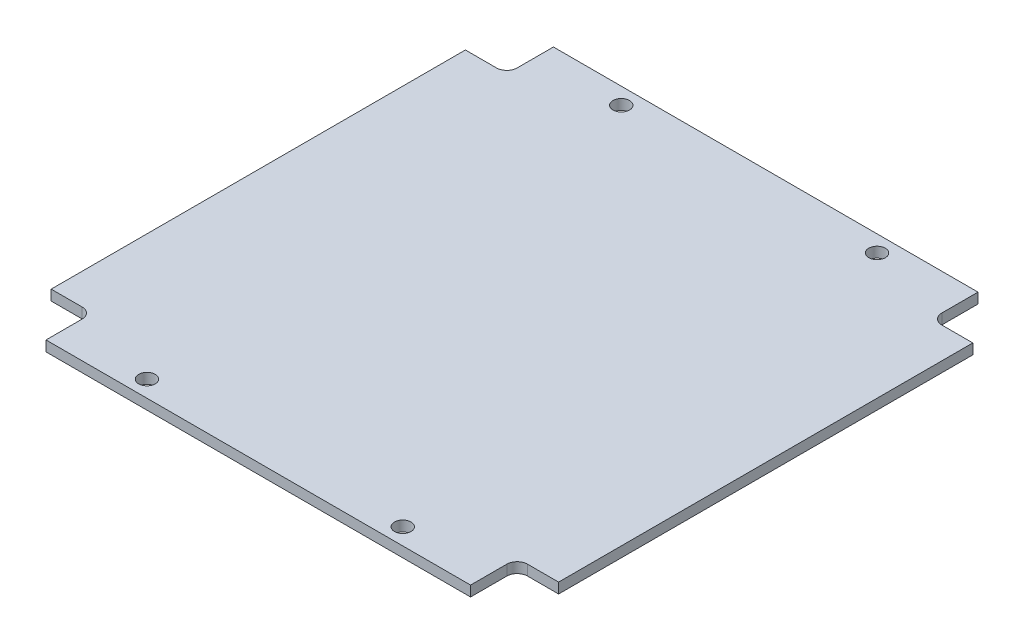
ISO-10303-21;
HEADER;
FILE_DESCRIPTION(('STEP AP214'),'2;1');
FILE_NAME('part.step','',(''),(''),'','','');
FILE_SCHEMA(('AUTOMOTIVE_DESIGN { 1 0 10303 214 1 1 1 1 }'));
ENDSEC;
DATA;
#1=APPLICATION_CONTEXT('core data for automotive mechanical design processes');
#2=APPLICATION_PROTOCOL_DEFINITION('international standard','automotive_design',2000,#1);
#3=PRODUCT_CONTEXT('',#1,'mechanical');
#4=PRODUCT('Part','Part','',(#3));
#5=PRODUCT_RELATED_PRODUCT_CATEGORY('part','',(#4));
#6=PRODUCT_DEFINITION_FORMATION('','',#4);
#7=PRODUCT_DEFINITION_CONTEXT('part definition',#1,'design');
#8=PRODUCT_DEFINITION('design','',#6,#7);
#9=PRODUCT_DEFINITION_SHAPE('','',#8);
#10=(LENGTH_UNIT() NAMED_UNIT(*) SI_UNIT(.MILLI.,.METRE.));
#11=(NAMED_UNIT(*) PLANE_ANGLE_UNIT() SI_UNIT($,.RADIAN.));
#12=(NAMED_UNIT(*) SI_UNIT($,.STERADIAN.) SOLID_ANGLE_UNIT());
#13=UNCERTAINTY_MEASURE_WITH_UNIT(LENGTH_MEASURE(1.E-05),#10,'distance_accuracy_value','');
#14=(GEOMETRIC_REPRESENTATION_CONTEXT(3) GLOBAL_UNCERTAINTY_ASSIGNED_CONTEXT((#13)) GLOBAL_UNIT_ASSIGNED_CONTEXT((#10,
#11,#12)) REPRESENTATION_CONTEXT('',''));
#15=CARTESIAN_POINT('',(0.,0.,0.));
#16=DIRECTION('',(0.,0.,1.));
#17=DIRECTION('',(1.,0.,0.));
#18=AXIS2_PLACEMENT_3D('',#15,#16,#17);
#19=CARTESIAN_POINT('',(-43.,2.,42.));
#20=DIRECTION('',(0.,-1.,0.));
#21=DIRECTION('',(0.,0.,-1.));
#22=AXIS2_PLACEMENT_3D('',#19,#20,#21);
#23=PLANE('',#22);
#24=DIRECTION('',(-1.,0.,0.));
#25=VECTOR('',#24,1.);
#26=CARTESIAN_POINT('',(-43.,2.,-40.));
#27=LINE('',#26,#25);
#28=CARTESIAN_POINT('',(-43.,2.,-40.));
#29=VERTEX_POINT('',#28);
#30=CARTESIAN_POINT('',(-49.,2.,-40.));
#31=VERTEX_POINT('',#30);
#32=EDGE_CURVE('E209',#29,#31,#27,.T.);
#33=ORIENTED_EDGE('',*,*,#32,.T.);
#34=DIRECTION('',(0.,0.,1.));
#35=VECTOR('',#34,1.);
#36=CARTESIAN_POINT('',(-49.,2.,-40.));
#37=LINE('',#36,#35);
#38=CARTESIAN_POINT('',(-49.,2.,40.));
#39=VERTEX_POINT('',#38);
#40=EDGE_CURVE('E117',#31,#39,#37,.T.);
#41=ORIENTED_EDGE('',*,*,#40,.T.);
#42=DIRECTION('',(1.,0.,0.));
#43=VECTOR('',#42,1.);
#44=CARTESIAN_POINT('',(-49.,2.,40.));
#45=LINE('',#44,#43);
#46=CARTESIAN_POINT('',(-43.,2.,40.));
#47=VERTEX_POINT('',#46);
#48=EDGE_CURVE('E248',#39,#47,#45,.T.);
#49=ORIENTED_EDGE('',*,*,#48,.T.);
#50=CARTESIAN_POINT('',(-43.,2.,42.));
#51=DIRECTION('',(0.,-1.,0.));
#52=DIRECTION('',(0.,0.,-1.));
#53=AXIS2_PLACEMENT_3D('',#50,#51,#52);
#54=CIRCLE('',#53,2.);
#55=CARTESIAN_POINT('',(-41.,2.,42.));
#56=VERTEX_POINT('',#55);
#57=EDGE_CURVE('E267',#47,#56,#54,.T.);
#58=ORIENTED_EDGE('',*,*,#57,.T.);
#59=DIRECTION('',(0.,0.,1.));
#60=VECTOR('',#59,1.);
#61=CARTESIAN_POINT('',(-41.,2.,42.));
#62=LINE('',#61,#60);
#63=CARTESIAN_POINT('',(-41.,2.,49.));
#64=VERTEX_POINT('',#63);
#65=EDGE_CURVE('E264',#56,#64,#62,.T.);
#66=ORIENTED_EDGE('',*,*,#65,.T.);
#67=DIRECTION('',(1.,0.,0.));
#68=VECTOR('',#67,1.);
#69=CARTESIAN_POINT('',(-41.,2.,49.));
#70=LINE('',#69,#68);
#71=CARTESIAN_POINT('',(41.,2.,49.));
#72=VERTEX_POINT('',#71);
#73=EDGE_CURVE('E266',#64,#72,#70,.T.);
#74=ORIENTED_EDGE('',*,*,#73,.T.);
#75=DIRECTION('',(0.,0.,-1.));
#76=VECTOR('',#75,1.);
#77=CARTESIAN_POINT('',(41.,2.,49.));
#78=LINE('',#77,#76);
#79=CARTESIAN_POINT('',(41.,2.,42.));
#80=VERTEX_POINT('',#79);
#81=EDGE_CURVE('E269',#72,#80,#78,.T.);
#82=ORIENTED_EDGE('',*,*,#81,.T.);
#83=CARTESIAN_POINT('',(43.,2.,42.));
#84=DIRECTION('',(0.,-1.,0.));
#85=DIRECTION('',(0.,0.,-1.));
#86=AXIS2_PLACEMENT_3D('',#83,#84,#85);
#87=CIRCLE('',#86,2.);
#88=CARTESIAN_POINT('',(43.,2.,40.));
#89=VERTEX_POINT('',#88);
#90=EDGE_CURVE('E275',#80,#89,#87,.T.);
#91=ORIENTED_EDGE('',*,*,#90,.T.);
#92=DIRECTION('',(1.,0.,0.));
#93=VECTOR('',#92,1.);
#94=CARTESIAN_POINT('',(43.,2.,40.));
#95=LINE('',#94,#93);
#96=CARTESIAN_POINT('',(49.,2.,40.));
#97=VERTEX_POINT('',#96);
#98=EDGE_CURVE('E277',#89,#97,#95,.T.);
#99=ORIENTED_EDGE('',*,*,#98,.T.);
#100=DIRECTION('',(0.,0.,-1.));
#101=VECTOR('',#100,1.);
#102=CARTESIAN_POINT('',(49.,2.,40.));
#103=LINE('',#102,#101);
#104=CARTESIAN_POINT('',(49.,2.,-40.));
#105=VERTEX_POINT('',#104);
#106=EDGE_CURVE('E279',#97,#105,#103,.T.);
#107=ORIENTED_EDGE('',*,*,#106,.T.);
#108=DIRECTION('',(-1.,0.,0.));
#109=VECTOR('',#108,1.);
#110=CARTESIAN_POINT('',(49.,2.,-40.));
#111=LINE('',#110,#109);
#112=CARTESIAN_POINT('',(43.,2.,-40.));
#113=VERTEX_POINT('',#112);
#114=EDGE_CURVE('E281',#105,#113,#111,.T.);
#115=ORIENTED_EDGE('',*,*,#114,.T.);
#116=CARTESIAN_POINT('',(43.,2.,-42.));
#117=DIRECTION('',(0.,-1.,0.));
#118=DIRECTION('',(0.,0.,-1.));
#119=AXIS2_PLACEMENT_3D('',#116,#117,#118);
#120=CIRCLE('',#119,2.);
#121=CARTESIAN_POINT('',(41.,2.,-42.));
#122=VERTEX_POINT('',#121);
#123=EDGE_CURVE('E283',#113,#122,#120,.T.);
#124=ORIENTED_EDGE('',*,*,#123,.T.);
#125=DIRECTION('',(0.,0.,-1.));
#126=VECTOR('',#125,1.);
#127=CARTESIAN_POINT('',(41.,2.,-42.));
#128=LINE('',#127,#126);
#129=CARTESIAN_POINT('',(41.,2.,-49.));
#130=VERTEX_POINT('',#129);
#131=EDGE_CURVE('E160',#122,#130,#128,.T.);
#132=ORIENTED_EDGE('',*,*,#131,.T.);
#133=DIRECTION('',(-1.,0.,0.));
#134=VECTOR('',#133,1.);
#135=CARTESIAN_POINT('',(41.,2.,-49.));
#136=LINE('',#135,#134);
#137=CARTESIAN_POINT('',(-41.,2.,-49.));
#138=VERTEX_POINT('',#137);
#139=EDGE_CURVE('E154',#130,#138,#136,.T.);
#140=ORIENTED_EDGE('',*,*,#139,.T.);
#141=DIRECTION('',(0.,0.,1.));
#142=VECTOR('',#141,1.);
#143=CARTESIAN_POINT('',(-41.,2.,-49.));
#144=LINE('',#143,#142);
#145=CARTESIAN_POINT('',(-41.,2.,-42.));
#146=VERTEX_POINT('',#145);
#147=EDGE_CURVE('E158',#138,#146,#144,.T.);
#148=ORIENTED_EDGE('',*,*,#147,.T.);
#149=CARTESIAN_POINT('',(-43.,2.,-42.));
#150=DIRECTION('',(0.,-1.,0.));
#151=DIRECTION('',(0.,0.,-1.));
#152=AXIS2_PLACEMENT_3D('',#149,#150,#151);
#153=CIRCLE('',#152,2.);
#154=EDGE_CURVE('E50',#146,#29,#153,.T.);
#155=ORIENTED_EDGE('',*,*,#154,.T.);
#156=EDGE_LOOP('',(#33,#41,#49,#58,#66,#74,#82,#91,#99,#107,#115,#124,#132,#140,#148,#155));
#157=FACE_BOUND('',#156,.T.);
#158=CARTESIAN_POINT('',(24.7,2.,45.8));
#159=DIRECTION('',(0.,1.,0.));
#160=DIRECTION('',(0.,0.,1.));
#161=AXIS2_PLACEMENT_3D('',#158,#159,#160);
#162=CIRCLE('',#161,1.59999999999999);
#163=CARTESIAN_POINT('',(24.7,2.,47.4));
#164=VERTEX_POINT('',#163);
#165=EDGE_CURVE('E352',#164,#164,#162,.T.);
#166=ORIENTED_EDGE('',*,*,#165,.F.);
#167=EDGE_LOOP('',(#166));
#168=FACE_BOUND('',#167,.T.);
#169=CARTESIAN_POINT('',(-24.7,2.,45.8));
#170=DIRECTION('',(0.,1.,0.));
#171=DIRECTION('',(0.,0.,1.));
#172=AXIS2_PLACEMENT_3D('',#169,#170,#171);
#173=CIRCLE('',#172,1.59999999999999);
#174=CARTESIAN_POINT('',(-24.7,2.,47.4));
#175=VERTEX_POINT('',#174);
#176=EDGE_CURVE('E346',#175,#175,#173,.T.);
#177=ORIENTED_EDGE('',*,*,#176,.F.);
#178=EDGE_LOOP('',(#177));
#179=FACE_BOUND('',#178,.T.);
#180=CARTESIAN_POINT('',(-24.7,2.,-45.8));
#181=DIRECTION('',(0.,1.,0.));
#182=DIRECTION('',(0.,0.,1.));
#183=AXIS2_PLACEMENT_3D('',#180,#181,#182);
#184=CIRCLE('',#183,1.59999999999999);
#185=CARTESIAN_POINT('',(-24.7,2.,-44.2));
#186=VERTEX_POINT('',#185);
#187=EDGE_CURVE('E338',#186,#186,#184,.T.);
#188=ORIENTED_EDGE('',*,*,#187,.F.);
#189=EDGE_LOOP('',(#188));
#190=FACE_BOUND('',#189,.T.);
#191=CARTESIAN_POINT('',(24.7,2.,-45.8));
#192=DIRECTION('',(0.,1.,0.));
#193=DIRECTION('',(0.,0.,1.));
#194=AXIS2_PLACEMENT_3D('',#191,#192,#193);
#195=CIRCLE('',#194,1.59999999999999);
#196=CARTESIAN_POINT('',(24.7,2.,-44.2));
#197=VERTEX_POINT('',#196);
#198=EDGE_CURVE('E335',#197,#197,#195,.T.);
#199=ORIENTED_EDGE('',*,*,#198,.F.);
#200=EDGE_LOOP('',(#199));
#201=FACE_BOUND('',#200,.T.);
#202=ADVANCED_FACE('F33',(#157,#168,#179,#190,#201),#23,.F.);
#203=CARTESIAN_POINT('',(-43.,0.,42.));
#204=DIRECTION('',(0.,-1.,0.));
#205=DIRECTION('',(0.,0.,-1.));
#206=AXIS2_PLACEMENT_3D('',#203,#204,#205);
#207=PLANE('',#206);
#208=CARTESIAN_POINT('',(24.7,0.,-45.8));
#209=DIRECTION('',(0.,1.,0.));
#210=DIRECTION('',(0.,0.,1.));
#211=AXIS2_PLACEMENT_3D('',#208,#209,#210);
#212=CIRCLE('',#211,1.59999999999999);
#213=CARTESIAN_POINT('',(24.7,0.,-44.2));
#214=VERTEX_POINT('',#213);
#215=EDGE_CURVE('E332',#214,#214,#212,.T.);
#216=ORIENTED_EDGE('',*,*,#215,.T.);
#217=EDGE_LOOP('',(#216));
#218=FACE_BOUND('',#217,.T.);
#219=CARTESIAN_POINT('',(-24.7,0.,-45.8));
#220=DIRECTION('',(0.,1.,0.));
#221=DIRECTION('',(0.,0.,1.));
#222=AXIS2_PLACEMENT_3D('',#219,#220,#221);
#223=CIRCLE('',#222,1.59999999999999);
#224=CARTESIAN_POINT('',(-24.7,0.,-44.2));
#225=VERTEX_POINT('',#224);
#226=EDGE_CURVE('E343',#225,#225,#223,.T.);
#227=ORIENTED_EDGE('',*,*,#226,.T.);
#228=EDGE_LOOP('',(#227));
#229=FACE_BOUND('',#228,.T.);
#230=CARTESIAN_POINT('',(-24.7,0.,45.8));
#231=DIRECTION('',(0.,1.,0.));
#232=DIRECTION('',(0.,0.,1.));
#233=AXIS2_PLACEMENT_3D('',#230,#231,#232);
#234=CIRCLE('',#233,1.59999999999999);
#235=CARTESIAN_POINT('',(-24.7,0.,47.4));
#236=VERTEX_POINT('',#235);
#237=EDGE_CURVE('E349',#236,#236,#234,.T.);
#238=ORIENTED_EDGE('',*,*,#237,.T.);
#239=EDGE_LOOP('',(#238));
#240=FACE_BOUND('',#239,.T.);
#241=DIRECTION('',(-1.,0.,0.));
#242=VECTOR('',#241,1.);
#243=CARTESIAN_POINT('',(-43.,0.,-40.));
#244=LINE('',#243,#242);
#245=CARTESIAN_POINT('',(-43.,0.,-40.));
#246=VERTEX_POINT('',#245);
#247=CARTESIAN_POINT('',(-49.,0.,-40.));
#248=VERTEX_POINT('',#247);
#249=EDGE_CURVE('E178',#246,#248,#244,.T.);
#250=ORIENTED_EDGE('',*,*,#249,.F.);
#251=CARTESIAN_POINT('',(-43.,0.,-42.));
#252=DIRECTION('',(0.,-1.,0.));
#253=DIRECTION('',(0.,0.,-1.));
#254=AXIS2_PLACEMENT_3D('',#251,#252,#253);
#255=CIRCLE('',#254,2.);
#256=CARTESIAN_POINT('',(-41.,0.,-42.));
#257=VERTEX_POINT('',#256);
#258=EDGE_CURVE('E109',#257,#246,#255,.T.);
#259=ORIENTED_EDGE('',*,*,#258,.F.);
#260=DIRECTION('',(0.,0.,1.));
#261=VECTOR('',#260,1.);
#262=CARTESIAN_POINT('',(-41.,0.,-49.));
#263=LINE('',#262,#261);
#264=CARTESIAN_POINT('',(-41.,0.,-49.));
#265=VERTEX_POINT('',#264);
#266=EDGE_CURVE('E103',#265,#257,#263,.T.);
#267=ORIENTED_EDGE('',*,*,#266,.F.);
#268=DIRECTION('',(-1.,0.,0.));
#269=VECTOR('',#268,1.);
#270=CARTESIAN_POINT('',(41.,0.,-49.));
#271=LINE('',#270,#269);
#272=CARTESIAN_POINT('',(41.,0.,-49.));
#273=VERTEX_POINT('',#272);
#274=EDGE_CURVE('E168',#273,#265,#271,.T.);
#275=ORIENTED_EDGE('',*,*,#274,.F.);
#276=DIRECTION('',(0.,0.,-1.));
#277=VECTOR('',#276,1.);
#278=CARTESIAN_POINT('',(41.,0.,-42.));
#279=LINE('',#278,#277);
#280=CARTESIAN_POINT('',(41.,0.,-42.));
#281=VERTEX_POINT('',#280);
#282=EDGE_CURVE('E204',#281,#273,#279,.T.);
#283=ORIENTED_EDGE('',*,*,#282,.F.);
#284=CARTESIAN_POINT('',(43.,0.,-42.));
#285=DIRECTION('',(0.,-1.,0.));
#286=DIRECTION('',(0.,0.,-1.));
#287=AXIS2_PLACEMENT_3D('',#284,#285,#286);
#288=CIRCLE('',#287,2.);
#289=CARTESIAN_POINT('',(43.,0.,-40.));
#290=VERTEX_POINT('',#289);
#291=EDGE_CURVE('E202',#290,#281,#288,.T.);
#292=ORIENTED_EDGE('',*,*,#291,.F.);
#293=DIRECTION('',(-1.,0.,0.));
#294=VECTOR('',#293,1.);
#295=CARTESIAN_POINT('',(49.,0.,-40.));
#296=LINE('',#295,#294);
#297=CARTESIAN_POINT('',(49.,0.,-40.));
#298=VERTEX_POINT('',#297);
#299=EDGE_CURVE('E200',#298,#290,#296,.T.);
#300=ORIENTED_EDGE('',*,*,#299,.F.);
#301=DIRECTION('',(0.,0.,-1.));
#302=VECTOR('',#301,1.);
#303=CARTESIAN_POINT('',(49.,0.,40.));
#304=LINE('',#303,#302);
#305=CARTESIAN_POINT('',(49.,0.,40.));
#306=VERTEX_POINT('',#305);
#307=EDGE_CURVE('E198',#306,#298,#304,.T.);
#308=ORIENTED_EDGE('',*,*,#307,.F.);
#309=DIRECTION('',(1.,0.,0.));
#310=VECTOR('',#309,1.);
#311=CARTESIAN_POINT('',(43.,0.,40.));
#312=LINE('',#311,#310);
#313=CARTESIAN_POINT('',(43.,0.,40.));
#314=VERTEX_POINT('',#313);
#315=EDGE_CURVE('E196',#314,#306,#312,.T.);
#316=ORIENTED_EDGE('',*,*,#315,.F.);
#317=CARTESIAN_POINT('',(43.,0.,42.));
#318=DIRECTION('',(0.,-1.,0.));
#319=DIRECTION('',(0.,0.,-1.));
#320=AXIS2_PLACEMENT_3D('',#317,#318,#319);
#321=CIRCLE('',#320,2.);
#322=CARTESIAN_POINT('',(41.,0.,42.));
#323=VERTEX_POINT('',#322);
#324=EDGE_CURVE('E194',#323,#314,#321,.T.);
#325=ORIENTED_EDGE('',*,*,#324,.F.);
#326=DIRECTION('',(0.,0.,-1.));
#327=VECTOR('',#326,1.);
#328=CARTESIAN_POINT('',(41.,0.,49.));
#329=LINE('',#328,#327);
#330=CARTESIAN_POINT('',(41.,0.,49.));
#331=VERTEX_POINT('',#330);
#332=EDGE_CURVE('E192',#331,#323,#329,.T.);
#333=ORIENTED_EDGE('',*,*,#332,.F.);
#334=DIRECTION('',(1.,0.,0.));
#335=VECTOR('',#334,1.);
#336=CARTESIAN_POINT('',(-41.,0.,49.));
#337=LINE('',#336,#335);
#338=CARTESIAN_POINT('',(-41.,0.,49.));
#339=VERTEX_POINT('',#338);
#340=EDGE_CURVE('E190',#339,#331,#337,.T.);
#341=ORIENTED_EDGE('',*,*,#340,.F.);
#342=DIRECTION('',(0.,0.,1.));
#343=VECTOR('',#342,1.);
#344=CARTESIAN_POINT('',(-41.,0.,42.));
#345=LINE('',#344,#343);
#346=CARTESIAN_POINT('',(-41.,0.,42.));
#347=VERTEX_POINT('',#346);
#348=EDGE_CURVE('E188',#347,#339,#345,.T.);
#349=ORIENTED_EDGE('',*,*,#348,.F.);
#350=CARTESIAN_POINT('',(-43.,0.,42.));
#351=DIRECTION('',(0.,-1.,0.));
#352=DIRECTION('',(0.,0.,-1.));
#353=AXIS2_PLACEMENT_3D('',#350,#351,#352);
#354=CIRCLE('',#353,2.);
#355=CARTESIAN_POINT('',(-43.,0.,40.));
#356=VERTEX_POINT('',#355);
#357=EDGE_CURVE('E186',#356,#347,#354,.T.);
#358=ORIENTED_EDGE('',*,*,#357,.F.);
#359=DIRECTION('',(1.,0.,0.));
#360=VECTOR('',#359,1.);
#361=CARTESIAN_POINT('',(-49.,0.,40.));
#362=LINE('',#361,#360);
#363=CARTESIAN_POINT('',(-49.,0.,40.));
#364=VERTEX_POINT('',#363);
#365=EDGE_CURVE('E184',#364,#356,#362,.T.);
#366=ORIENTED_EDGE('',*,*,#365,.F.);
#367=DIRECTION('',(0.,0.,1.));
#368=VECTOR('',#367,1.);
#369=CARTESIAN_POINT('',(-49.,0.,-40.));
#370=LINE('',#369,#368);
#371=EDGE_CURVE('E181',#248,#364,#370,.T.);
#372=ORIENTED_EDGE('',*,*,#371,.F.);
#373=EDGE_LOOP('',(#250,#259,#267,#275,#283,#292,#300,#308,#316,#325,#333,#341,#349,#358,#366,#372));
#374=FACE_BOUND('',#373,.T.);
#375=CARTESIAN_POINT('',(24.7,0.,45.8));
#376=DIRECTION('',(0.,1.,0.));
#377=DIRECTION('',(0.,0.,1.));
#378=AXIS2_PLACEMENT_3D('',#375,#376,#377);
#379=CIRCLE('',#378,1.59999999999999);
#380=CARTESIAN_POINT('',(24.7,0.,47.4));
#381=VERTEX_POINT('',#380);
#382=EDGE_CURVE('E182',#381,#381,#379,.T.);
#383=ORIENTED_EDGE('',*,*,#382,.T.);
#384=EDGE_LOOP('',(#383));
#385=FACE_BOUND('',#384,.T.);
#386=ADVANCED_FACE('F252',(#218,#229,#240,#374,#385),#207,.T.);
#387=CARTESIAN_POINT('',(-43.,2.,-40.));
#388=DIRECTION('',(0.,0.,1.));
#389=DIRECTION('',(1.,0.,0.));
#390=AXIS2_PLACEMENT_3D('',#387,#388,#389);
#391=PLANE('',#390);
#392=ORIENTED_EDGE('',*,*,#249,.T.);
#393=DIRECTION('',(0.,-1.,0.));
#394=VECTOR('',#393,1.);
#395=CARTESIAN_POINT('',(-49.,2.,-40.));
#396=LINE('',#395,#394);
#397=EDGE_CURVE('E11',#31,#248,#396,.T.);
#398=ORIENTED_EDGE('',*,*,#397,.F.);
#399=ORIENTED_EDGE('',*,*,#32,.F.);
#400=DIRECTION('',(0.,-1.,0.));
#401=VECTOR('',#400,1.);
#402=CARTESIAN_POINT('',(-43.,2.,-40.));
#403=LINE('',#402,#401);
#404=EDGE_CURVE('E174',#29,#246,#403,.T.);
#405=ORIENTED_EDGE('',*,*,#404,.T.);
#406=EDGE_LOOP('',(#392,#398,#399,#405));
#407=FACE_BOUND('',#406,.T.);
#408=ADVANCED_FACE('F35',(#407),#391,.F.);
#409=CARTESIAN_POINT('',(-49.,2.,-40.));
#410=DIRECTION('',(1.,0.,0.));
#411=DIRECTION('',(0.,0.,-1.));
#412=AXIS2_PLACEMENT_3D('',#409,#410,#411);
#413=PLANE('',#412);
#414=ORIENTED_EDGE('',*,*,#371,.T.);
#415=DIRECTION('',(0.,-1.,0.));
#416=VECTOR('',#415,1.);
#417=CARTESIAN_POINT('',(-49.,2.,40.));
#418=LINE('',#417,#416);
#419=EDGE_CURVE('E42',#39,#364,#418,.T.);
#420=ORIENTED_EDGE('',*,*,#419,.F.);
#421=ORIENTED_EDGE('',*,*,#40,.F.);
#422=ORIENTED_EDGE('',*,*,#397,.T.);
#423=EDGE_LOOP('',(#414,#420,#421,#422));
#424=FACE_BOUND('',#423,.T.);
#425=ADVANCED_FACE('F513',(#424),#413,.F.);
#426=CARTESIAN_POINT('',(-49.,2.,40.));
#427=DIRECTION('',(0.,0.,-1.));
#428=DIRECTION('',(-1.,0.,0.));
#429=AXIS2_PLACEMENT_3D('',#426,#427,#428);
#430=PLANE('',#429);
#431=ORIENTED_EDGE('',*,*,#365,.T.);
#432=DIRECTION('',(0.,-1.,0.));
#433=VECTOR('',#432,1.);
#434=CARTESIAN_POINT('',(-43.,2.,40.));
#435=LINE('',#434,#433);
#436=EDGE_CURVE('E240',#47,#356,#435,.T.);
#437=ORIENTED_EDGE('',*,*,#436,.F.);
#438=ORIENTED_EDGE('',*,*,#48,.F.);
#439=ORIENTED_EDGE('',*,*,#419,.T.);
#440=EDGE_LOOP('',(#431,#437,#438,#439));
#441=FACE_BOUND('',#440,.T.);
#442=ADVANCED_FACE('F246',(#441),#430,.F.);
#443=CARTESIAN_POINT('',(-43.,2.,42.));
#444=DIRECTION('',(0.,-1.,0.));
#445=DIRECTION('',(0.,0.,-1.));
#446=AXIS2_PLACEMENT_3D('',#443,#444,#445);
#447=CYLINDRICAL_SURFACE('',#446,2.);
#448=ORIENTED_EDGE('',*,*,#357,.T.);
#449=DIRECTION('',(0.,-1.,0.));
#450=VECTOR('',#449,1.);
#451=CARTESIAN_POINT('',(-41.,2.,42.));
#452=LINE('',#451,#450);
#453=EDGE_CURVE('E237',#56,#347,#452,.T.);
#454=ORIENTED_EDGE('',*,*,#453,.F.);
#455=ORIENTED_EDGE('',*,*,#57,.F.);
#456=ORIENTED_EDGE('',*,*,#436,.T.);
#457=EDGE_LOOP('',(#448,#454,#455,#456));
#458=FACE_BOUND('',#457,.T.);
#459=ADVANCED_FACE('F258',(#458),#447,.F.);
#460=CARTESIAN_POINT('',(-41.,2.,42.));
#461=DIRECTION('',(1.,0.,0.));
#462=DIRECTION('',(0.,0.,-1.));
#463=AXIS2_PLACEMENT_3D('',#460,#461,#462);
#464=PLANE('',#463);
#465=ORIENTED_EDGE('',*,*,#348,.T.);
#466=DIRECTION('',(0.,-1.,0.));
#467=VECTOR('',#466,1.);
#468=CARTESIAN_POINT('',(-41.,2.,49.));
#469=LINE('',#468,#467);
#470=EDGE_CURVE('E234',#64,#339,#469,.T.);
#471=ORIENTED_EDGE('',*,*,#470,.F.);
#472=ORIENTED_EDGE('',*,*,#65,.F.);
#473=ORIENTED_EDGE('',*,*,#453,.T.);
#474=EDGE_LOOP('',(#465,#471,#472,#473));
#475=FACE_BOUND('',#474,.T.);
#476=ADVANCED_FACE('F262',(#475),#464,.F.);
#477=CARTESIAN_POINT('',(-41.,2.,49.));
#478=DIRECTION('',(0.,0.,-1.));
#479=DIRECTION('',(-1.,0.,0.));
#480=AXIS2_PLACEMENT_3D('',#477,#478,#479);
#481=PLANE('',#480);
#482=ORIENTED_EDGE('',*,*,#340,.T.);
#483=DIRECTION('',(0.,-1.,0.));
#484=VECTOR('',#483,1.);
#485=CARTESIAN_POINT('',(41.,2.,49.));
#486=LINE('',#485,#484);
#487=EDGE_CURVE('E231',#72,#331,#486,.T.);
#488=ORIENTED_EDGE('',*,*,#487,.F.);
#489=ORIENTED_EDGE('',*,*,#73,.F.);
#490=ORIENTED_EDGE('',*,*,#470,.T.);
#491=EDGE_LOOP('',(#482,#488,#489,#490));
#492=FACE_BOUND('',#491,.T.);
#493=ADVANCED_FACE('F478',(#492),#481,.F.);
#494=CARTESIAN_POINT('',(41.,2.,49.));
#495=DIRECTION('',(-1.,0.,0.));
#496=DIRECTION('',(0.,0.,1.));
#497=AXIS2_PLACEMENT_3D('',#494,#495,#496);
#498=PLANE('',#497);
#499=ORIENTED_EDGE('',*,*,#332,.T.);
#500=DIRECTION('',(0.,-1.,0.));
#501=VECTOR('',#500,1.);
#502=CARTESIAN_POINT('',(41.,2.,42.));
#503=LINE('',#502,#501);
#504=EDGE_CURVE('E228',#80,#323,#503,.T.);
#505=ORIENTED_EDGE('',*,*,#504,.F.);
#506=ORIENTED_EDGE('',*,*,#81,.F.);
#507=ORIENTED_EDGE('',*,*,#487,.T.);
#508=EDGE_LOOP('',(#499,#505,#506,#507));
#509=FACE_BOUND('',#508,.T.);
#510=ADVANCED_FACE('F468',(#509),#498,.F.);
#511=CARTESIAN_POINT('',(43.,2.,42.));
#512=DIRECTION('',(0.,-1.,0.));
#513=DIRECTION('',(0.,0.,-1.));
#514=AXIS2_PLACEMENT_3D('',#511,#512,#513);
#515=CYLINDRICAL_SURFACE('',#514,2.);
#516=ORIENTED_EDGE('',*,*,#324,.T.);
#517=DIRECTION('',(0.,-1.,0.));
#518=VECTOR('',#517,1.);
#519=CARTESIAN_POINT('',(43.,2.,40.));
#520=LINE('',#519,#518);
#521=EDGE_CURVE('E225',#89,#314,#520,.T.);
#522=ORIENTED_EDGE('',*,*,#521,.F.);
#523=ORIENTED_EDGE('',*,*,#90,.F.);
#524=ORIENTED_EDGE('',*,*,#504,.T.);
#525=EDGE_LOOP('',(#516,#522,#523,#524));
#526=FACE_BOUND('',#525,.T.);
#527=ADVANCED_FACE('F458',(#526),#515,.F.);
#528=CARTESIAN_POINT('',(43.,2.,40.));
#529=DIRECTION('',(0.,0.,-1.));
#530=DIRECTION('',(-1.,0.,0.));
#531=AXIS2_PLACEMENT_3D('',#528,#529,#530);
#532=PLANE('',#531);
#533=ORIENTED_EDGE('',*,*,#315,.T.);
#534=DIRECTION('',(0.,-1.,0.));
#535=VECTOR('',#534,1.);
#536=CARTESIAN_POINT('',(49.,2.,40.));
#537=LINE('',#536,#535);
#538=EDGE_CURVE('E222',#97,#306,#537,.T.);
#539=ORIENTED_EDGE('',*,*,#538,.F.);
#540=ORIENTED_EDGE('',*,*,#98,.F.);
#541=ORIENTED_EDGE('',*,*,#521,.T.);
#542=EDGE_LOOP('',(#533,#539,#540,#541));
#543=FACE_BOUND('',#542,.T.);
#544=ADVANCED_FACE('F448',(#543),#532,.F.);
#545=CARTESIAN_POINT('',(49.,2.,40.));
#546=DIRECTION('',(-1.,0.,0.));
#547=DIRECTION('',(0.,0.,1.));
#548=AXIS2_PLACEMENT_3D('',#545,#546,#547);
#549=PLANE('',#548);
#550=ORIENTED_EDGE('',*,*,#307,.T.);
#551=DIRECTION('',(0.,-1.,0.));
#552=VECTOR('',#551,1.);
#553=CARTESIAN_POINT('',(49.,2.,-40.));
#554=LINE('',#553,#552);
#555=EDGE_CURVE('E219',#105,#298,#554,.T.);
#556=ORIENTED_EDGE('',*,*,#555,.F.);
#557=ORIENTED_EDGE('',*,*,#106,.F.);
#558=ORIENTED_EDGE('',*,*,#538,.T.);
#559=EDGE_LOOP('',(#550,#556,#557,#558));
#560=FACE_BOUND('',#559,.T.);
#561=ADVANCED_FACE('F438',(#560),#549,.F.);
#562=CARTESIAN_POINT('',(49.,2.,-40.));
#563=DIRECTION('',(0.,0.,1.));
#564=DIRECTION('',(1.,0.,0.));
#565=AXIS2_PLACEMENT_3D('',#562,#563,#564);
#566=PLANE('',#565);
#567=ORIENTED_EDGE('',*,*,#299,.T.);
#568=DIRECTION('',(0.,-1.,0.));
#569=VECTOR('',#568,1.);
#570=CARTESIAN_POINT('',(43.,2.,-40.));
#571=LINE('',#570,#569);
#572=EDGE_CURVE('E216',#113,#290,#571,.T.);
#573=ORIENTED_EDGE('',*,*,#572,.F.);
#574=ORIENTED_EDGE('',*,*,#114,.F.);
#575=ORIENTED_EDGE('',*,*,#555,.T.);
#576=EDGE_LOOP('',(#567,#573,#574,#575));
#577=FACE_BOUND('',#576,.T.);
#578=ADVANCED_FACE('F429',(#577),#566,.F.);
#579=CARTESIAN_POINT('',(43.,2.,-42.));
#580=DIRECTION('',(0.,-1.,0.));
#581=DIRECTION('',(0.,0.,-1.));
#582=AXIS2_PLACEMENT_3D('',#579,#580,#581);
#583=CYLINDRICAL_SURFACE('',#582,2.);
#584=ORIENTED_EDGE('',*,*,#291,.T.);
#585=DIRECTION('',(0.,-1.,0.));
#586=VECTOR('',#585,1.);
#587=CARTESIAN_POINT('',(41.,2.,-42.));
#588=LINE('',#587,#586);
#589=EDGE_CURVE('E213',#122,#281,#588,.T.);
#590=ORIENTED_EDGE('',*,*,#589,.F.);
#591=ORIENTED_EDGE('',*,*,#123,.F.);
#592=ORIENTED_EDGE('',*,*,#572,.T.);
#593=EDGE_LOOP('',(#584,#590,#591,#592));
#594=FACE_BOUND('',#593,.T.);
#595=ADVANCED_FACE('F289',(#594),#583,.F.);
#596=CARTESIAN_POINT('',(41.,2.,-42.));
#597=DIRECTION('',(-1.,0.,0.));
#598=DIRECTION('',(0.,0.,1.));
#599=AXIS2_PLACEMENT_3D('',#596,#597,#598);
#600=PLANE('',#599);
#601=ORIENTED_EDGE('',*,*,#282,.T.);
#602=DIRECTION('',(0.,-1.,0.));
#603=VECTOR('',#602,1.);
#604=CARTESIAN_POINT('',(41.,2.,-49.));
#605=LINE('',#604,#603);
#606=EDGE_CURVE('E169',#130,#273,#605,.T.);
#607=ORIENTED_EDGE('',*,*,#606,.F.);
#608=ORIENTED_EDGE('',*,*,#131,.F.);
#609=ORIENTED_EDGE('',*,*,#589,.T.);
#610=EDGE_LOOP('',(#601,#607,#608,#609));
#611=FACE_BOUND('',#610,.T.);
#612=ADVANCED_FACE('F293',(#611),#600,.F.);
#613=CARTESIAN_POINT('',(41.,2.,-49.));
#614=DIRECTION('',(0.,0.,1.));
#615=DIRECTION('',(1.,0.,0.));
#616=AXIS2_PLACEMENT_3D('',#613,#614,#615);
#617=PLANE('',#616);
#618=ORIENTED_EDGE('',*,*,#274,.T.);
#619=DIRECTION('',(0.,-1.,0.));
#620=VECTOR('',#619,1.);
#621=CARTESIAN_POINT('',(-41.,2.,-49.));
#622=LINE('',#621,#620);
#623=EDGE_CURVE('E165',#138,#265,#622,.T.);
#624=ORIENTED_EDGE('',*,*,#623,.F.);
#625=ORIENTED_EDGE('',*,*,#139,.F.);
#626=ORIENTED_EDGE('',*,*,#606,.T.);
#627=EDGE_LOOP('',(#618,#624,#625,#626));
#628=FACE_BOUND('',#627,.T.);
#629=ADVANCED_FACE('F166',(#628),#617,.F.);
#630=CARTESIAN_POINT('',(-41.,2.,-49.));
#631=DIRECTION('',(1.,0.,0.));
#632=DIRECTION('',(0.,0.,-1.));
#633=AXIS2_PLACEMENT_3D('',#630,#631,#632);
#634=PLANE('',#633);
#635=ORIENTED_EDGE('',*,*,#266,.T.);
#636=DIRECTION('',(0.,-1.,0.));
#637=VECTOR('',#636,1.);
#638=CARTESIAN_POINT('',(-41.,2.,-42.));
#639=LINE('',#638,#637);
#640=EDGE_CURVE('E170',#146,#257,#639,.T.);
#641=ORIENTED_EDGE('',*,*,#640,.F.);
#642=ORIENTED_EDGE('',*,*,#147,.F.);
#643=ORIENTED_EDGE('',*,*,#623,.T.);
#644=EDGE_LOOP('',(#635,#641,#642,#643));
#645=FACE_BOUND('',#644,.T.);
#646=ADVANCED_FACE('F172',(#645),#634,.F.);
#647=CARTESIAN_POINT('',(-43.,2.,-42.));
#648=DIRECTION('',(0.,-1.,0.));
#649=DIRECTION('',(0.,0.,-1.));
#650=AXIS2_PLACEMENT_3D('',#647,#648,#649);
#651=CYLINDRICAL_SURFACE('',#650,2.);
#652=ORIENTED_EDGE('',*,*,#258,.T.);
#653=ORIENTED_EDGE('',*,*,#404,.F.);
#654=ORIENTED_EDGE('',*,*,#154,.F.);
#655=ORIENTED_EDGE('',*,*,#640,.T.);
#656=EDGE_LOOP('',(#652,#653,#654,#655));
#657=FACE_BOUND('',#656,.T.);
#658=ADVANCED_FACE('F297',(#657),#651,.F.);
#659=CARTESIAN_POINT('',(24.7,2.,45.8));
#660=DIRECTION('',(0.,1.,0.));
#661=DIRECTION('',(0.,0.,1.));
#662=AXIS2_PLACEMENT_3D('',#659,#660,#661);
#663=CYLINDRICAL_SURFACE('',#662,1.59999999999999);
#664=ORIENTED_EDGE('',*,*,#382,.F.);
#665=EDGE_LOOP('',(#664));
#666=FACE_BOUND('',#665,.T.);
#667=ORIENTED_EDGE('',*,*,#165,.T.);
#668=EDGE_LOOP('',(#667));
#669=FACE_BOUND('',#668,.T.);
#670=ADVANCED_FACE('F299',(#666,#669),#663,.F.);
#671=CARTESIAN_POINT('',(-24.7,2.,45.8));
#672=DIRECTION('',(0.,1.,0.));
#673=DIRECTION('',(0.,0.,1.));
#674=AXIS2_PLACEMENT_3D('',#671,#672,#673);
#675=CYLINDRICAL_SURFACE('',#674,1.59999999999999);
#676=ORIENTED_EDGE('',*,*,#237,.F.);
#677=EDGE_LOOP('',(#676));
#678=FACE_BOUND('',#677,.T.);
#679=ORIENTED_EDGE('',*,*,#176,.T.);
#680=EDGE_LOOP('',(#679));
#681=FACE_BOUND('',#680,.T.);
#682=ADVANCED_FACE('F305',(#678,#681),#675,.F.);
#683=CARTESIAN_POINT('',(-24.7,2.,-45.8));
#684=DIRECTION('',(0.,1.,0.));
#685=DIRECTION('',(0.,0.,1.));
#686=AXIS2_PLACEMENT_3D('',#683,#684,#685);
#687=CYLINDRICAL_SURFACE('',#686,1.59999999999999);
#688=ORIENTED_EDGE('',*,*,#226,.F.);
#689=EDGE_LOOP('',(#688));
#690=FACE_BOUND('',#689,.T.);
#691=ORIENTED_EDGE('',*,*,#187,.T.);
#692=EDGE_LOOP('',(#691));
#693=FACE_BOUND('',#692,.T.);
#694=ADVANCED_FACE('F319',(#690,#693),#687,.F.);
#695=CARTESIAN_POINT('',(24.7,2.,-45.8));
#696=DIRECTION('',(0.,1.,0.));
#697=DIRECTION('',(0.,0.,1.));
#698=AXIS2_PLACEMENT_3D('',#695,#696,#697);
#699=CYLINDRICAL_SURFACE('',#698,1.59999999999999);
#700=ORIENTED_EDGE('',*,*,#215,.F.);
#701=EDGE_LOOP('',(#700));
#702=FACE_BOUND('',#701,.T.);
#703=ORIENTED_EDGE('',*,*,#198,.T.);
#704=EDGE_LOOP('',(#703));
#705=FACE_BOUND('',#704,.T.);
#706=ADVANCED_FACE('F323',(#702,#705),#699,.F.);
#707=CLOSED_SHELL('',(#202,#386,#408,#425,#442,#459,#476,#493,#510,#527,#544,#561,#578,#595,
#612,#629,#646,#658,#670,#682,#694,#706));
#708=MANIFOLD_SOLID_BREP('B2',#707);
#709=ADVANCED_BREP_SHAPE_REPRESENTATION('',(#18,#708),#14);
#710=SHAPE_DEFINITION_REPRESENTATION(#9,#709);
ENDSEC;
END-ISO-10303-21;
